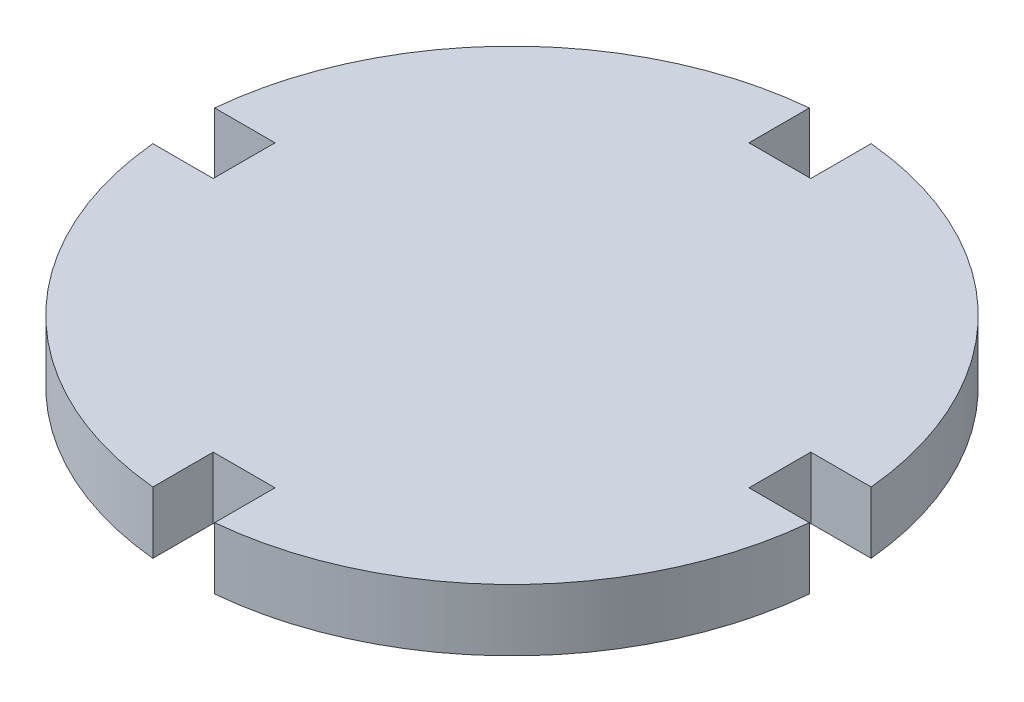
from build123d import *

# Parameters (mm, degrees)
CROQUIS1_R              = 16
SALIENTE_EXTRUIR1_DEPTH = 3
CROQUIS2_W              = 3
CROQUIS2_H              = 6
CORTAR_EXTRUIR2_DEPTH   = 23.825424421
MATRIZC1_COUNT          = 4


with BuildPart() as part:
    # Croquis1 → Saliente-Extruir1 (new body)
    with BuildSketch(Plane(origin=(0, 0, 0), x_dir=(1, 0, 0), z_dir=(0, 1, 0))):
        with Locations(Location((0, 0, 0), (0, 0, 270))):
            Circle(CROQUIS1_R)
    extrude(amount=SALIENTE_EXTRUIR1_DEPTH)

    # Croquis2 → Cortar-Extruir2 (cut, through all)
    with BuildSketch(Plane(origin=(0, 3, 0), x_dir=(1, 0, 0), z_dir=(0, 1, 0))):
        with Locations((0, 16)):
            Rectangle(CROQUIS2_W, CROQUIS2_H)
    cortar_extruir2 = extrude(amount=-CORTAR_EXTRUIR2_DEPTH, mode=Mode.SUBTRACT)

    # MatrizC1: Cortar-Extruir2 ×4 about axis
    matrizc1_axis = Axis((0, 0, 0), (0, 1, 0))
    for i in range(1, MATRIZC1_COUNT):
        add(cortar_extruir2.rotate(matrizc1_axis, i * 360 / MATRIZC1_COUNT), mode=Mode.SUBTRACT)


solid = part.part
